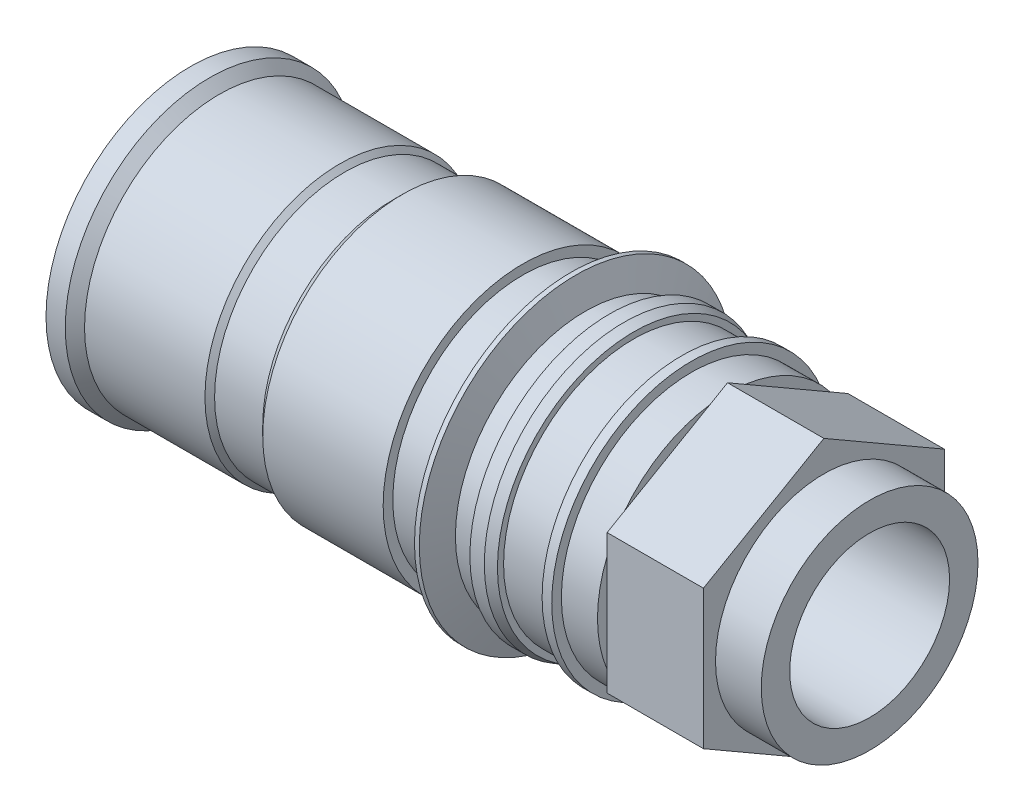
from build123d import *

# Parameters (mm, degrees)
SALIENTE_EXTRUIR1_DEPTH = 20
CROQUIS3_R              = 22.5
SALIENTE_EXTRUIR2_DEPTH = 9.5
CROQUIS4_R              = 16.6
CORTAR_EXTRUIR1_DEPTH   = 149.299845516


with BuildPart() as part:
    # Croquis1 → Revoluci_n1 (revolve)
    with BuildSketch(Plane.XY, mode=Mode.PRIVATE) as revoluci_n1_sk:
        Polygon((0, 0), (0, 30), (4, 30), (6, 28), (31, 28), (32, 27), (42, 27), (44, 29), (69, 29), (69, 27), (77, 27), (79, 32.494954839), (80, 32.494954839), (82, 27), (87, 27), (87, 29), (90, 29), (92, 28.272059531), (92, 27), (102, 27), (102, 29), (104, 29), (104, 27), (111.5, 27), (111.5, 0), align=None)
    revolve(revoluci_n1_sk.sketch.rotate(Axis((0, 0, 0), (1, 0, 0)), 90), axis=Axis((0, 0, 0), (1, 0, 0)))

    # Croquis2 → Saliente-Extruir1 (add)
    with BuildSketch(Plane(origin=(111.5, 0, 0), x_dir=(0, 0, -1), z_dir=(1, 0, 0))):
        Polygon((0, 28.867513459), (-25, 14.43375673), (-25, -14.43375673), (0, -28.867513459), (25, -14.43375673), (25, 14.43375673), align=None)
    extrude(amount=SALIENTE_EXTRUIR1_DEPTH)

    # Croquis3 → Saliente-Extruir2 (add)
    with BuildSketch(Plane(origin=(131.5, 0, 0), x_dir=(0, 0, -1), z_dir=(1, 0, 0))):
        Circle(CROQUIS3_R)
    extrude(amount=SALIENTE_EXTRUIR2_DEPTH)

    # Croquis4 → Cortar-Extruir1 (cut, through all)
    with BuildSketch(Plane(origin=(141, 0, 0), x_dir=(0, 0, -1), z_dir=(1, 0, 0))):
        Circle(CROQUIS4_R)
    extrude(amount=-CORTAR_EXTRUIR1_DEPTH, mode=Mode.SUBTRACT)


solid = part.part
